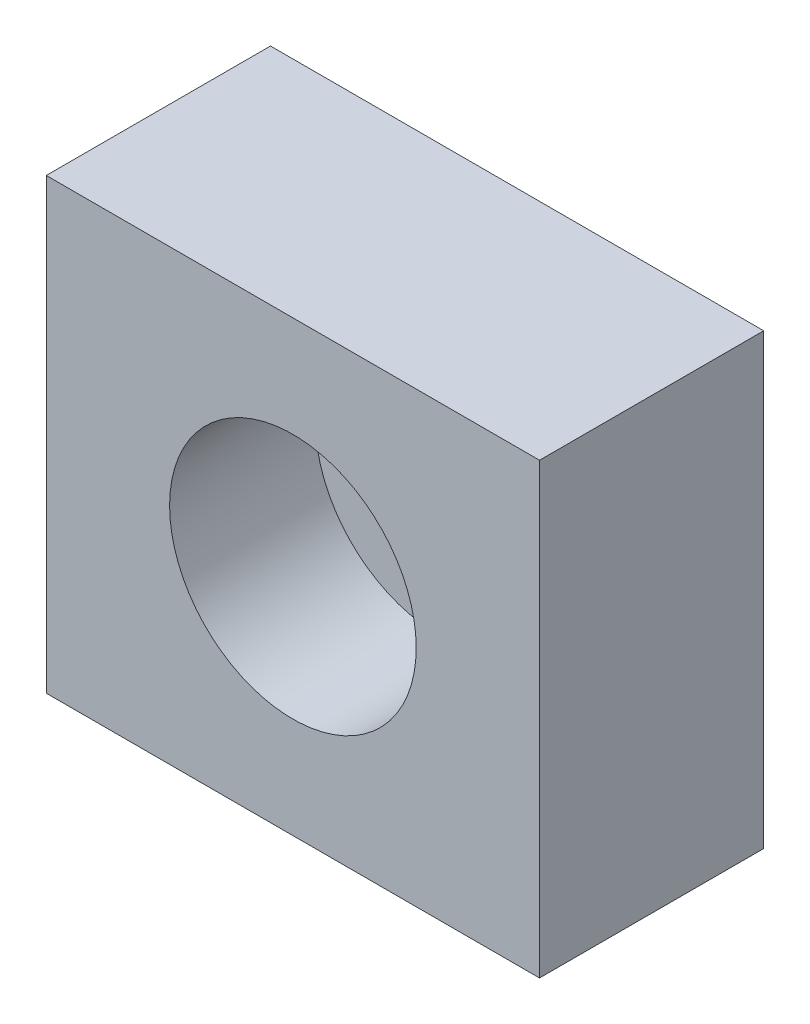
ISO-10303-21;
HEADER;
FILE_DESCRIPTION(('STEP AP214'),'2;1');
FILE_NAME('part.step','',(''),(''),'','','');
FILE_SCHEMA(('AUTOMOTIVE_DESIGN { 1 0 10303 214 1 1 1 1 }'));
ENDSEC;
DATA;
#1=APPLICATION_CONTEXT('core data for automotive mechanical design processes');
#2=APPLICATION_PROTOCOL_DEFINITION('international standard','automotive_design',2000,#1);
#3=PRODUCT_CONTEXT('',#1,'mechanical');
#4=PRODUCT('Part','Part','',(#3));
#5=PRODUCT_RELATED_PRODUCT_CATEGORY('part','',(#4));
#6=PRODUCT_DEFINITION_FORMATION('','',#4);
#7=PRODUCT_DEFINITION_CONTEXT('part definition',#1,'design');
#8=PRODUCT_DEFINITION('design','',#6,#7);
#9=PRODUCT_DEFINITION_SHAPE('','',#8);
#10=(LENGTH_UNIT() NAMED_UNIT(*) SI_UNIT(.MILLI.,.METRE.));
#11=(NAMED_UNIT(*) PLANE_ANGLE_UNIT() SI_UNIT($,.RADIAN.));
#12=(NAMED_UNIT(*) SI_UNIT($,.STERADIAN.) SOLID_ANGLE_UNIT());
#13=UNCERTAINTY_MEASURE_WITH_UNIT(LENGTH_MEASURE(1.E-05),#10,'distance_accuracy_value','');
#14=(GEOMETRIC_REPRESENTATION_CONTEXT(3) GLOBAL_UNCERTAINTY_ASSIGNED_CONTEXT((#13)) GLOBAL_UNIT_ASSIGNED_CONTEXT((#10,
#11,#12)) REPRESENTATION_CONTEXT('',''));
#15=CARTESIAN_POINT('',(0.,0.,0.));
#16=DIRECTION('',(0.,0.,1.));
#17=DIRECTION('',(1.,0.,0.));
#18=AXIS2_PLACEMENT_3D('',#15,#16,#17);
#19=CARTESIAN_POINT('',(11.,-10.,10.));
#20=DIRECTION('',(0.,0.,1.));
#21=DIRECTION('',(1.,0.,0.));
#22=AXIS2_PLACEMENT_3D('',#19,#20,#21);
#23=PLANE('',#22);
#24=DIRECTION('',(1.,0.,0.));
#25=VECTOR('',#24,1.);
#26=CARTESIAN_POINT('',(-11.,-10.,10.));
#27=LINE('',#26,#25);
#28=CARTESIAN_POINT('',(-11.,-10.,10.));
#29=VERTEX_POINT('',#28);
#30=CARTESIAN_POINT('',(11.,-10.,10.));
#31=VERTEX_POINT('',#30);
#32=EDGE_CURVE('E84',#29,#31,#27,.T.);
#33=ORIENTED_EDGE('',*,*,#32,.T.);
#34=DIRECTION('',(0.,1.,0.));
#35=VECTOR('',#34,1.);
#36=CARTESIAN_POINT('',(11.,-10.,10.));
#37=LINE('',#36,#35);
#38=CARTESIAN_POINT('',(11.,10.,10.));
#39=VERTEX_POINT('',#38);
#40=EDGE_CURVE('E61',#31,#39,#37,.T.);
#41=ORIENTED_EDGE('',*,*,#40,.T.);
#42=DIRECTION('',(-1.,0.,0.));
#43=VECTOR('',#42,1.);
#44=CARTESIAN_POINT('',(11.,10.,10.));
#45=LINE('',#44,#43);
#46=CARTESIAN_POINT('',(-11.,10.,10.));
#47=VERTEX_POINT('',#46);
#48=EDGE_CURVE('E81',#39,#47,#45,.T.);
#49=ORIENTED_EDGE('',*,*,#48,.T.);
#50=DIRECTION('',(0.,-1.,0.));
#51=VECTOR('',#50,1.);
#52=CARTESIAN_POINT('',(-11.,10.,10.));
#53=LINE('',#52,#51);
#54=EDGE_CURVE('E78',#47,#29,#53,.T.);
#55=ORIENTED_EDGE('',*,*,#54,.T.);
#56=EDGE_LOOP('',(#33,#41,#49,#55));
#57=FACE_BOUND('',#56,.T.);
#58=CARTESIAN_POINT('',(0.,0.,10.));
#59=DIRECTION('',(0.,0.,1.));
#60=DIRECTION('',(1.,0.,0.));
#61=AXIS2_PLACEMENT_3D('',#58,#59,#60);
#62=CIRCLE('',#61,5.5);
#63=CARTESIAN_POINT('',(5.5,0.,10.));
#64=VERTEX_POINT('',#63);
#65=EDGE_CURVE('E69',#64,#64,#62,.T.);
#66=ORIENTED_EDGE('',*,*,#65,.F.);
#67=EDGE_LOOP('',(#66));
#68=FACE_BOUND('',#67,.T.);
#69=ADVANCED_FACE('F14',(#57,#68),#23,.T.);
#70=CARTESIAN_POINT('',(-11.,-10.,10.));
#71=DIRECTION('',(0.,1.,0.));
#72=DIRECTION('',(0.,0.,1.));
#73=AXIS2_PLACEMENT_3D('',#70,#71,#72);
#74=PLANE('',#73);
#75=DIRECTION('',(0.,0.,-1.));
#76=VECTOR('',#75,1.);
#77=CARTESIAN_POINT('',(11.,-10.,10.));
#78=LINE('',#77,#76);
#79=CARTESIAN_POINT('',(11.,-10.,0.));
#80=VERTEX_POINT('',#79);
#81=EDGE_CURVE('E9',#31,#80,#78,.T.);
#82=ORIENTED_EDGE('',*,*,#81,.F.);
#83=ORIENTED_EDGE('',*,*,#32,.F.);
#84=DIRECTION('',(0.,0.,-1.));
#85=VECTOR('',#84,1.);
#86=CARTESIAN_POINT('',(-11.,-10.,10.));
#87=LINE('',#86,#85);
#88=CARTESIAN_POINT('',(-11.,-10.,0.));
#89=VERTEX_POINT('',#88);
#90=EDGE_CURVE('E29',#29,#89,#87,.T.);
#91=ORIENTED_EDGE('',*,*,#90,.T.);
#92=DIRECTION('',(1.,0.,0.));
#93=VECTOR('',#92,1.);
#94=CARTESIAN_POINT('',(-11.,-10.,0.));
#95=LINE('',#94,#93);
#96=EDGE_CURVE('E65',#89,#80,#95,.T.);
#97=ORIENTED_EDGE('',*,*,#96,.T.);
#98=EDGE_LOOP('',(#82,#83,#91,#97));
#99=FACE_BOUND('',#98,.T.);
#100=ADVANCED_FACE('F66',(#99),#74,.F.);
#101=CARTESIAN_POINT('',(11.,-10.,10.));
#102=DIRECTION('',(-1.,0.,0.));
#103=DIRECTION('',(0.,0.,1.));
#104=AXIS2_PLACEMENT_3D('',#101,#102,#103);
#105=PLANE('',#104);
#106=DIRECTION('',(0.,0.,-1.));
#107=VECTOR('',#106,1.);
#108=CARTESIAN_POINT('',(11.,10.,10.));
#109=LINE('',#108,#107);
#110=CARTESIAN_POINT('',(11.,10.,0.));
#111=VERTEX_POINT('',#110);
#112=EDGE_CURVE('E22',#39,#111,#109,.T.);
#113=ORIENTED_EDGE('',*,*,#112,.F.);
#114=ORIENTED_EDGE('',*,*,#40,.F.);
#115=ORIENTED_EDGE('',*,*,#81,.T.);
#116=DIRECTION('',(0.,1.,0.));
#117=VECTOR('',#116,1.);
#118=CARTESIAN_POINT('',(11.,-10.,0.));
#119=LINE('',#118,#117);
#120=EDGE_CURVE('E58',#80,#111,#119,.T.);
#121=ORIENTED_EDGE('',*,*,#120,.T.);
#122=EDGE_LOOP('',(#113,#114,#115,#121));
#123=FACE_BOUND('',#122,.T.);
#124=ADVANCED_FACE('F16',(#123),#105,.F.);
#125=CARTESIAN_POINT('',(11.,10.,10.));
#126=DIRECTION('',(0.,-1.,0.));
#127=DIRECTION('',(1.,0.,0.));
#128=AXIS2_PLACEMENT_3D('',#125,#126,#127);
#129=PLANE('',#128);
#130=DIRECTION('',(0.,0.,-1.));
#131=VECTOR('',#130,1.);
#132=CARTESIAN_POINT('',(-11.,10.,10.));
#133=LINE('',#132,#131);
#134=CARTESIAN_POINT('',(-11.,10.,0.));
#135=VERTEX_POINT('',#134);
#136=EDGE_CURVE('E37',#47,#135,#133,.T.);
#137=ORIENTED_EDGE('',*,*,#136,.F.);
#138=ORIENTED_EDGE('',*,*,#48,.F.);
#139=ORIENTED_EDGE('',*,*,#112,.T.);
#140=DIRECTION('',(-1.,0.,0.));
#141=VECTOR('',#140,1.);
#142=CARTESIAN_POINT('',(11.,10.,0.));
#143=LINE('',#142,#141);
#144=EDGE_CURVE('E72',#111,#135,#143,.T.);
#145=ORIENTED_EDGE('',*,*,#144,.T.);
#146=EDGE_LOOP('',(#137,#138,#139,#145));
#147=FACE_BOUND('',#146,.T.);
#148=ADVANCED_FACE('F87',(#147),#129,.F.);
#149=CARTESIAN_POINT('',(-11.,10.,10.));
#150=DIRECTION('',(1.,0.,0.));
#151=DIRECTION('',(0.,1.,0.));
#152=AXIS2_PLACEMENT_3D('',#149,#150,#151);
#153=PLANE('',#152);
#154=ORIENTED_EDGE('',*,*,#54,.F.);
#155=ORIENTED_EDGE('',*,*,#136,.T.);
#156=DIRECTION('',(0.,-1.,0.));
#157=VECTOR('',#156,1.);
#158=CARTESIAN_POINT('',(-11.,10.,0.));
#159=LINE('',#158,#157);
#160=EDGE_CURVE('E74',#135,#89,#159,.T.);
#161=ORIENTED_EDGE('',*,*,#160,.T.);
#162=ORIENTED_EDGE('',*,*,#90,.F.);
#163=EDGE_LOOP('',(#154,#155,#161,#162));
#164=FACE_BOUND('',#163,.T.);
#165=ADVANCED_FACE('F90',(#164),#153,.F.);
#166=CARTESIAN_POINT('',(11.,-10.,0.));
#167=DIRECTION('',(0.,0.,1.));
#168=DIRECTION('',(1.,0.,0.));
#169=AXIS2_PLACEMENT_3D('',#166,#167,#168);
#170=PLANE('',#169);
#171=CARTESIAN_POINT('',(0.,0.,0.));
#172=DIRECTION('',(0.,0.,1.));
#173=DIRECTION('',(1.,0.,0.));
#174=AXIS2_PLACEMENT_3D('',#171,#172,#173);
#175=CIRCLE('',#174,3.5);
#176=CARTESIAN_POINT('',(3.5,0.,0.));
#177=VERTEX_POINT('',#176);
#178=EDGE_CURVE('E100',#177,#177,#175,.T.);
#179=ORIENTED_EDGE('',*,*,#178,.T.);
#180=EDGE_LOOP('',(#179));
#181=FACE_BOUND('',#180,.T.);
#182=ORIENTED_EDGE('',*,*,#96,.F.);
#183=ORIENTED_EDGE('',*,*,#160,.F.);
#184=ORIENTED_EDGE('',*,*,#144,.F.);
#185=ORIENTED_EDGE('',*,*,#120,.F.);
#186=EDGE_LOOP('',(#182,#183,#184,#185));
#187=FACE_BOUND('',#186,.T.);
#188=ADVANCED_FACE('F71',(#181,#187),#170,.F.);
#189=CARTESIAN_POINT('',(0.,0.,10.));
#190=DIRECTION('',(0.,0.,1.));
#191=DIRECTION('',(1.,0.,0.));
#192=AXIS2_PLACEMENT_3D('',#189,#190,#191);
#193=CYLINDRICAL_SURFACE('',#192,5.5);
#194=ORIENTED_EDGE('',*,*,#65,.T.);
#195=EDGE_LOOP('',(#194));
#196=FACE_BOUND('',#195,.T.);
#197=CARTESIAN_POINT('',(0.,0.,3.5));
#198=DIRECTION('',(0.,0.,1.));
#199=DIRECTION('',(1.,0.,0.));
#200=AXIS2_PLACEMENT_3D('',#197,#198,#199);
#201=CIRCLE('',#200,5.5);
#202=CARTESIAN_POINT('',(5.5,0.,3.5));
#203=VERTEX_POINT('',#202);
#204=EDGE_CURVE('E94',#203,#203,#201,.T.);
#205=ORIENTED_EDGE('',*,*,#204,.F.);
#206=EDGE_LOOP('',(#205));
#207=FACE_BOUND('',#206,.T.);
#208=ADVANCED_FACE('F114',(#196,#207),#193,.F.);
#209=CARTESIAN_POINT('',(3.5,0.,3.5));
#210=DIRECTION('',(0.,0.,1.));
#211=DIRECTION('',(1.,0.,0.));
#212=AXIS2_PLACEMENT_3D('',#209,#210,#211);
#213=PLANE('',#212);
#214=ORIENTED_EDGE('',*,*,#204,.T.);
#215=EDGE_LOOP('',(#214));
#216=FACE_BOUND('',#215,.T.);
#217=CARTESIAN_POINT('',(0.,0.,3.5));
#218=DIRECTION('',(0.,0.,1.));
#219=DIRECTION('',(1.,0.,0.));
#220=AXIS2_PLACEMENT_3D('',#217,#218,#219);
#221=CIRCLE('',#220,3.5);
#222=CARTESIAN_POINT('',(3.5,0.,3.5));
#223=VERTEX_POINT('',#222);
#224=EDGE_CURVE('E97',#223,#223,#221,.T.);
#225=ORIENTED_EDGE('',*,*,#224,.F.);
#226=EDGE_LOOP('',(#225));
#227=FACE_BOUND('',#226,.T.);
#228=ADVANCED_FACE('F107',(#216,#227),#213,.T.);
#229=CARTESIAN_POINT('',(0.,0.,10.));
#230=DIRECTION('',(0.,0.,1.));
#231=DIRECTION('',(1.,0.,0.));
#232=AXIS2_PLACEMENT_3D('',#229,#230,#231);
#233=CYLINDRICAL_SURFACE('',#232,3.5);
#234=ORIENTED_EDGE('',*,*,#224,.T.);
#235=EDGE_LOOP('',(#234));
#236=FACE_BOUND('',#235,.T.);
#237=ORIENTED_EDGE('',*,*,#178,.F.);
#238=EDGE_LOOP('',(#237));
#239=FACE_BOUND('',#238,.T.);
#240=ADVANCED_FACE('F105',(#236,#239),#233,.F.);
#241=CLOSED_SHELL('',(#69,#100,#124,#148,#165,#188,#208,#228,#240));
#242=MANIFOLD_SOLID_BREP('B1',#241);
#243=ADVANCED_BREP_SHAPE_REPRESENTATION('',(#18,#242),#14);
#244=SHAPE_DEFINITION_REPRESENTATION(#9,#243);
ENDSEC;
END-ISO-10303-21;
